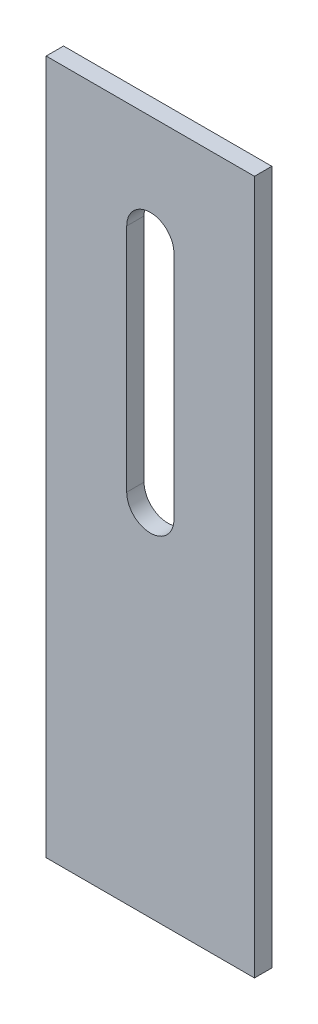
ISO-10303-21;
HEADER;
FILE_DESCRIPTION(('STEP AP214'),'2;1');
FILE_NAME('part.step','',(''),(''),'','','');
FILE_SCHEMA(('AUTOMOTIVE_DESIGN { 1 0 10303 214 1 1 1 1 }'));
ENDSEC;
DATA;
#1=APPLICATION_CONTEXT('core data for automotive mechanical design processes');
#2=APPLICATION_PROTOCOL_DEFINITION('international standard','automotive_design',2000,#1);
#3=PRODUCT_CONTEXT('',#1,'mechanical');
#4=PRODUCT('Part','Part','',(#3));
#5=PRODUCT_RELATED_PRODUCT_CATEGORY('part','',(#4));
#6=PRODUCT_DEFINITION_FORMATION('','',#4);
#7=PRODUCT_DEFINITION_CONTEXT('part definition',#1,'design');
#8=PRODUCT_DEFINITION('design','',#6,#7);
#9=PRODUCT_DEFINITION_SHAPE('','',#8);
#10=(LENGTH_UNIT() NAMED_UNIT(*) SI_UNIT(.MILLI.,.METRE.));
#11=(NAMED_UNIT(*) PLANE_ANGLE_UNIT() SI_UNIT($,.RADIAN.));
#12=(NAMED_UNIT(*) SI_UNIT($,.STERADIAN.) SOLID_ANGLE_UNIT());
#13=UNCERTAINTY_MEASURE_WITH_UNIT(LENGTH_MEASURE(1.E-05),#10,'distance_accuracy_value','');
#14=(GEOMETRIC_REPRESENTATION_CONTEXT(3) GLOBAL_UNCERTAINTY_ASSIGNED_CONTEXT((#13)) GLOBAL_UNIT_ASSIGNED_CONTEXT((#10,
#11,#12)) REPRESENTATION_CONTEXT('',''));
#15=CARTESIAN_POINT('',(0.,0.,0.));
#16=DIRECTION('',(0.,0.,1.));
#17=DIRECTION('',(1.,0.,0.));
#18=AXIS2_PLACEMENT_3D('',#15,#16,#17);
#19=CARTESIAN_POINT('',(-15.,-4.71844785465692E-13,2.50000000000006));
#20=DIRECTION('',(0.,0.,0.999999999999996));
#21=DIRECTION('',(0.999999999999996,0.,0.));
#22=AXIS2_PLACEMENT_3D('',#19,#20,#21);
#23=PLANE('',#22);
#24=DIRECTION('',(0.,-1.,0.));
#25=VECTOR('',#24,1.);
#26=CARTESIAN_POINT('',(-15.,100.,2.50000000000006));
#27=LINE('',#26,#25);
#28=CARTESIAN_POINT('',(-15.,100.,2.50000000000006));
#29=VERTEX_POINT('',#28);
#30=CARTESIAN_POINT('',(-15.,-4.71844785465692E-13,2.50000000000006));
#31=VERTEX_POINT('',#30);
#32=EDGE_CURVE('E156',#29,#31,#27,.T.);
#33=ORIENTED_EDGE('',*,*,#32,.T.);
#34=DIRECTION('',(0.999999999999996,0.,0.));
#35=VECTOR('',#34,1.);
#36=CARTESIAN_POINT('',(-15.,-4.71844785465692E-13,2.50000000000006));
#37=LINE('',#36,#35);
#38=CARTESIAN_POINT('',(15.,-4.71844785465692E-13,2.49999999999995));
#39=VERTEX_POINT('',#38);
#40=EDGE_CURVE('E160',#31,#39,#37,.T.);
#41=ORIENTED_EDGE('',*,*,#40,.T.);
#42=DIRECTION('',(0.,1.,0.));
#43=VECTOR('',#42,1.);
#44=CARTESIAN_POINT('',(15.,100.,2.50000000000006));
#45=LINE('',#44,#43);
#46=CARTESIAN_POINT('',(15.,100.,2.50000000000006));
#47=VERTEX_POINT('',#46);
#48=EDGE_CURVE('E164',#39,#47,#45,.T.);
#49=ORIENTED_EDGE('',*,*,#48,.T.);
#50=DIRECTION('',(-0.999999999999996,0.,0.));
#51=VECTOR('',#50,1.);
#52=CARTESIAN_POINT('',(-15.,100.,2.50000000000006));
#53=LINE('',#52,#51);
#54=EDGE_CURVE('E167',#47,#29,#53,.T.);
#55=ORIENTED_EDGE('',*,*,#54,.T.);
#56=EDGE_LOOP('',(#33,#41,#49,#55));
#57=FACE_BOUND('',#56,.T.);
#58=DIRECTION('',(0.,-1.,0.));
#59=VECTOR('',#58,1.);
#60=CARTESIAN_POINT('',(-3.40000000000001,84.6,2.50000000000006));
#61=LINE('',#60,#59);
#62=CARTESIAN_POINT('',(-3.40000000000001,84.6,2.50000000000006));
#63=VERTEX_POINT('',#62);
#64=CARTESIAN_POINT('',(-3.40000000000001,51.4,2.50000000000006));
#65=VERTEX_POINT('',#64);
#66=EDGE_CURVE('E115',#63,#65,#61,.T.);
#67=ORIENTED_EDGE('',*,*,#66,.F.);
#68=CARTESIAN_POINT('',(0.,84.5999999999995,2.50000000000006));
#69=DIRECTION('',(0.,0.,0.999999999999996));
#70=DIRECTION('',(-0.999999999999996,0.,0.));
#71=AXIS2_PLACEMENT_3D('',#68,#69,#70);
#72=CIRCLE('',#71,3.4);
#73=CARTESIAN_POINT('',(3.40000000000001,84.6,2.50000000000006));
#74=VERTEX_POINT('',#73);
#75=EDGE_CURVE('E106',#74,#63,#72,.T.);
#76=ORIENTED_EDGE('',*,*,#75,.F.);
#77=DIRECTION('',(0.,1.,0.));
#78=VECTOR('',#77,1.);
#79=CARTESIAN_POINT('',(3.40000000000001,84.6,2.50000000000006));
#80=LINE('',#79,#78);
#81=CARTESIAN_POINT('',(3.40000000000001,51.4,2.50000000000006));
#82=VERTEX_POINT('',#81);
#83=EDGE_CURVE('E134',#82,#74,#80,.T.);
#84=ORIENTED_EDGE('',*,*,#83,.F.);
#85=CARTESIAN_POINT('',(0.,51.3999999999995,2.50000000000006));
#86=DIRECTION('',(0.,0.,0.999999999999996));
#87=DIRECTION('',(0.999999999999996,0.,0.));
#88=AXIS2_PLACEMENT_3D('',#85,#86,#87);
#89=CIRCLE('',#88,3.4);
#90=EDGE_CURVE('E128',#65,#82,#89,.T.);
#91=ORIENTED_EDGE('',*,*,#90,.F.);
#92=EDGE_LOOP('',(#67,#76,#84,#91));
#93=FACE_BOUND('',#92,.T.);
#94=ADVANCED_FACE('F40',(#57,#93),#23,.T.);
#95=CARTESIAN_POINT('',(-15.,-4.71844785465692E-13,0.));
#96=DIRECTION('',(0.,0.,0.999999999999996));
#97=DIRECTION('',(0.999999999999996,0.,0.));
#98=AXIS2_PLACEMENT_3D('',#95,#96,#97);
#99=PLANE('',#98);
#100=DIRECTION('',(0.,-1.,0.));
#101=VECTOR('',#100,1.);
#102=CARTESIAN_POINT('',(-15.,100.,0.));
#103=LINE('',#102,#101);
#104=CARTESIAN_POINT('',(-15.,100.,0.));
#105=VERTEX_POINT('',#104);
#106=CARTESIAN_POINT('',(-15.,-4.71844785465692E-13,0.));
#107=VERTEX_POINT('',#106);
#108=EDGE_CURVE('E124',#105,#107,#103,.T.);
#109=ORIENTED_EDGE('',*,*,#108,.F.);
#110=DIRECTION('',(-0.999999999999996,0.,0.));
#111=VECTOR('',#110,1.);
#112=CARTESIAN_POINT('',(-15.,100.,0.));
#113=LINE('',#112,#111);
#114=CARTESIAN_POINT('',(15.,100.,0.));
#115=VERTEX_POINT('',#114);
#116=EDGE_CURVE('E161',#115,#105,#113,.T.);
#117=ORIENTED_EDGE('',*,*,#116,.F.);
#118=DIRECTION('',(0.,1.,0.));
#119=VECTOR('',#118,1.);
#120=CARTESIAN_POINT('',(15.,100.,0.));
#121=LINE('',#120,#119);
#122=CARTESIAN_POINT('',(15.,-4.71844785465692E-13,0.));
#123=VERTEX_POINT('',#122);
#124=EDGE_CURVE('E177',#123,#115,#121,.T.);
#125=ORIENTED_EDGE('',*,*,#124,.F.);
#126=DIRECTION('',(0.999999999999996,0.,0.));
#127=VECTOR('',#126,1.);
#128=CARTESIAN_POINT('',(-15.,-4.71844785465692E-13,0.));
#129=LINE('',#128,#127);
#130=EDGE_CURVE('E174',#107,#123,#129,.T.);
#131=ORIENTED_EDGE('',*,*,#130,.F.);
#132=EDGE_LOOP('',(#109,#117,#125,#131));
#133=FACE_BOUND('',#132,.T.);
#134=CARTESIAN_POINT('',(0.,84.5999999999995,0.));
#135=DIRECTION('',(0.,0.,0.999999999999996));
#136=DIRECTION('',(-0.999999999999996,0.,0.));
#137=AXIS2_PLACEMENT_3D('',#134,#135,#136);
#138=CIRCLE('',#137,3.4);
#139=CARTESIAN_POINT('',(3.40000000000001,84.6,0.));
#140=VERTEX_POINT('',#139);
#141=CARTESIAN_POINT('',(-3.40000000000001,84.6,0.));
#142=VERTEX_POINT('',#141);
#143=EDGE_CURVE('E64',#140,#142,#138,.T.);
#144=ORIENTED_EDGE('',*,*,#143,.T.);
#145=DIRECTION('',(0.,-1.,0.));
#146=VECTOR('',#145,1.);
#147=CARTESIAN_POINT('',(-3.40000000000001,84.6,0.));
#148=LINE('',#147,#146);
#149=CARTESIAN_POINT('',(-3.40000000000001,51.4,0.));
#150=VERTEX_POINT('',#149);
#151=EDGE_CURVE('E122',#142,#150,#148,.T.);
#152=ORIENTED_EDGE('',*,*,#151,.T.);
#153=CARTESIAN_POINT('',(0.,51.3999999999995,0.));
#154=DIRECTION('',(0.,0.,0.999999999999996));
#155=DIRECTION('',(0.999999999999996,0.,0.));
#156=AXIS2_PLACEMENT_3D('',#153,#154,#155);
#157=CIRCLE('',#156,3.4);
#158=CARTESIAN_POINT('',(3.40000000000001,51.4,0.));
#159=VERTEX_POINT('',#158);
#160=EDGE_CURVE('E143',#150,#159,#157,.T.);
#161=ORIENTED_EDGE('',*,*,#160,.T.);
#162=DIRECTION('',(0.,1.,0.));
#163=VECTOR('',#162,1.);
#164=CARTESIAN_POINT('',(3.40000000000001,84.6,0.));
#165=LINE('',#164,#163);
#166=EDGE_CURVE('E116',#159,#140,#165,.T.);
#167=ORIENTED_EDGE('',*,*,#166,.T.);
#168=EDGE_LOOP('',(#144,#152,#161,#167));
#169=FACE_BOUND('',#168,.T.);
#170=ADVANCED_FACE('F198',(#133,#169),#99,.F.);
#171=CARTESIAN_POINT('',(-15.,100.,2.50000000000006));
#172=DIRECTION('',(0.999999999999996,0.,0.));
#173=DIRECTION('',(0.,1.,0.));
#174=AXIS2_PLACEMENT_3D('',#171,#172,#173);
#175=PLANE('',#174);
#176=ORIENTED_EDGE('',*,*,#108,.T.);
#177=DIRECTION('',(0.,0.,-0.999999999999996));
#178=VECTOR('',#177,1.);
#179=CARTESIAN_POINT('',(-15.,-4.71844785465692E-13,2.50000000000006));
#180=LINE('',#179,#178);
#181=EDGE_CURVE('E11',#31,#107,#180,.T.);
#182=ORIENTED_EDGE('',*,*,#181,.F.);
#183=ORIENTED_EDGE('',*,*,#32,.F.);
#184=DIRECTION('',(0.,0.,-0.999999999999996));
#185=VECTOR('',#184,1.);
#186=CARTESIAN_POINT('',(-15.,100.,2.50000000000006));
#187=LINE('',#186,#185);
#188=EDGE_CURVE('E170',#29,#105,#187,.T.);
#189=ORIENTED_EDGE('',*,*,#188,.T.);
#190=EDGE_LOOP('',(#176,#182,#183,#189));
#191=FACE_BOUND('',#190,.T.);
#192=ADVANCED_FACE('F42',(#191),#175,.F.);
#193=CARTESIAN_POINT('',(-15.,-4.71844785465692E-13,2.50000000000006));
#194=DIRECTION('',(0.,1.,0.));
#195=DIRECTION('',(0.,0.,0.999999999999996));
#196=AXIS2_PLACEMENT_3D('',#193,#194,#195);
#197=PLANE('',#196);
#198=ORIENTED_EDGE('',*,*,#130,.T.);
#199=DIRECTION('',(0.,0.,-0.999999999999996));
#200=VECTOR('',#199,1.);
#201=CARTESIAN_POINT('',(15.,-4.71844785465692E-13,2.49999999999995));
#202=LINE('',#201,#200);
#203=EDGE_CURVE('E49',#39,#123,#202,.T.);
#204=ORIENTED_EDGE('',*,*,#203,.F.);
#205=ORIENTED_EDGE('',*,*,#40,.F.);
#206=ORIENTED_EDGE('',*,*,#181,.T.);
#207=EDGE_LOOP('',(#198,#204,#205,#206));
#208=FACE_BOUND('',#207,.T.);
#209=ADVANCED_FACE('F208',(#208),#197,.F.);
#210=CARTESIAN_POINT('',(15.,100.,2.50000000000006));
#211=DIRECTION('',(-0.999999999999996,0.,0.));
#212=DIRECTION('',(0.,-1.,0.));
#213=AXIS2_PLACEMENT_3D('',#210,#211,#212);
#214=PLANE('',#213);
#215=ORIENTED_EDGE('',*,*,#124,.T.);
#216=DIRECTION('',(0.,0.,-0.999999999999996));
#217=VECTOR('',#216,1.);
#218=CARTESIAN_POINT('',(15.,100.,2.50000000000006));
#219=LINE('',#218,#217);
#220=EDGE_CURVE('E184',#47,#115,#219,.T.);
#221=ORIENTED_EDGE('',*,*,#220,.F.);
#222=ORIENTED_EDGE('',*,*,#48,.F.);
#223=ORIENTED_EDGE('',*,*,#203,.T.);
#224=EDGE_LOOP('',(#215,#221,#222,#223));
#225=FACE_BOUND('',#224,.T.);
#226=ADVANCED_FACE('F192',(#225),#214,.F.);
#227=CARTESIAN_POINT('',(-15.,100.,2.50000000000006));
#228=DIRECTION('',(0.,-1.,0.));
#229=DIRECTION('',(0.,0.,-0.999999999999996));
#230=AXIS2_PLACEMENT_3D('',#227,#228,#229);
#231=PLANE('',#230);
#232=ORIENTED_EDGE('',*,*,#116,.T.);
#233=ORIENTED_EDGE('',*,*,#188,.F.);
#234=ORIENTED_EDGE('',*,*,#54,.F.);
#235=ORIENTED_EDGE('',*,*,#220,.T.);
#236=EDGE_LOOP('',(#232,#233,#234,#235));
#237=FACE_BOUND('',#236,.T.);
#238=ADVANCED_FACE('F202',(#237),#231,.F.);
#239=CARTESIAN_POINT('',(0.,84.5999999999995,2.50000000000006));
#240=DIRECTION('',(0.,0.,-0.999999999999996));
#241=DIRECTION('',(-0.999999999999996,0.,0.));
#242=AXIS2_PLACEMENT_3D('',#239,#240,#241);
#243=CYLINDRICAL_SURFACE('',#242,3.4);
#244=ORIENTED_EDGE('',*,*,#143,.F.);
#245=DIRECTION('',(0.,0.,-0.999999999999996));
#246=VECTOR('',#245,1.);
#247=CARTESIAN_POINT('',(3.40000000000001,84.6,2.50000000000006));
#248=LINE('',#247,#246);
#249=EDGE_CURVE('E110',#74,#140,#248,.T.);
#250=ORIENTED_EDGE('',*,*,#249,.F.);
#251=ORIENTED_EDGE('',*,*,#75,.T.);
#252=DIRECTION('',(0.,0.,-0.999999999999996));
#253=VECTOR('',#252,1.);
#254=CARTESIAN_POINT('',(-3.40000000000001,84.6,2.50000000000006));
#255=LINE('',#254,#253);
#256=EDGE_CURVE('E109',#63,#142,#255,.T.);
#257=ORIENTED_EDGE('',*,*,#256,.T.);
#258=EDGE_LOOP('',(#244,#250,#251,#257));
#259=FACE_BOUND('',#258,.T.);
#260=ADVANCED_FACE('F108',(#259),#243,.F.);
#261=CARTESIAN_POINT('',(-3.40000000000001,84.6,2.50000000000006));
#262=DIRECTION('',(0.999999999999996,0.,0.));
#263=DIRECTION('',(0.,1.,0.));
#264=AXIS2_PLACEMENT_3D('',#261,#262,#263);
#265=PLANE('',#264);
#266=ORIENTED_EDGE('',*,*,#151,.F.);
#267=ORIENTED_EDGE('',*,*,#256,.F.);
#268=ORIENTED_EDGE('',*,*,#66,.T.);
#269=DIRECTION('',(0.,0.,-0.999999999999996));
#270=VECTOR('',#269,1.);
#271=CARTESIAN_POINT('',(-3.40000000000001,51.4,2.50000000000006));
#272=LINE('',#271,#270);
#273=EDGE_CURVE('E125',#65,#150,#272,.T.);
#274=ORIENTED_EDGE('',*,*,#273,.T.);
#275=EDGE_LOOP('',(#266,#267,#268,#274));
#276=FACE_BOUND('',#275,.T.);
#277=ADVANCED_FACE('F119',(#276),#265,.T.);
#278=CARTESIAN_POINT('',(0.,51.3999999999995,2.50000000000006));
#279=DIRECTION('',(0.,0.,-0.999999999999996));
#280=DIRECTION('',(-0.999999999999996,0.,0.));
#281=AXIS2_PLACEMENT_3D('',#278,#279,#280);
#282=CYLINDRICAL_SURFACE('',#281,3.4);
#283=ORIENTED_EDGE('',*,*,#160,.F.);
#284=ORIENTED_EDGE('',*,*,#273,.F.);
#285=ORIENTED_EDGE('',*,*,#90,.T.);
#286=DIRECTION('',(0.,0.,-0.999999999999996));
#287=VECTOR('',#286,1.);
#288=CARTESIAN_POINT('',(3.40000000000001,51.4,2.50000000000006));
#289=LINE('',#288,#287);
#290=EDGE_CURVE('E56',#82,#159,#289,.T.);
#291=ORIENTED_EDGE('',*,*,#290,.T.);
#292=EDGE_LOOP('',(#283,#284,#285,#291));
#293=FACE_BOUND('',#292,.T.);
#294=ADVANCED_FACE('F231',(#293),#282,.F.);
#295=CARTESIAN_POINT('',(3.40000000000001,84.6,2.50000000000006));
#296=DIRECTION('',(-0.999999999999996,0.,0.));
#297=DIRECTION('',(0.,-1.,0.));
#298=AXIS2_PLACEMENT_3D('',#295,#296,#297);
#299=PLANE('',#298);
#300=ORIENTED_EDGE('',*,*,#166,.F.);
#301=ORIENTED_EDGE('',*,*,#290,.F.);
#302=ORIENTED_EDGE('',*,*,#83,.T.);
#303=ORIENTED_EDGE('',*,*,#249,.T.);
#304=EDGE_LOOP('',(#300,#301,#302,#303));
#305=FACE_BOUND('',#304,.T.);
#306=ADVANCED_FACE('F235',(#305),#299,.T.);
#307=CLOSED_SHELL('',(#94,#170,#192,#209,#226,#238,#260,#277,#294,#306));
#308=MANIFOLD_SOLID_BREP('B2',#307);
#309=ADVANCED_BREP_SHAPE_REPRESENTATION('',(#18,#308),#14);
#310=SHAPE_DEFINITION_REPRESENTATION(#9,#309);
ENDSEC;
END-ISO-10303-21;
